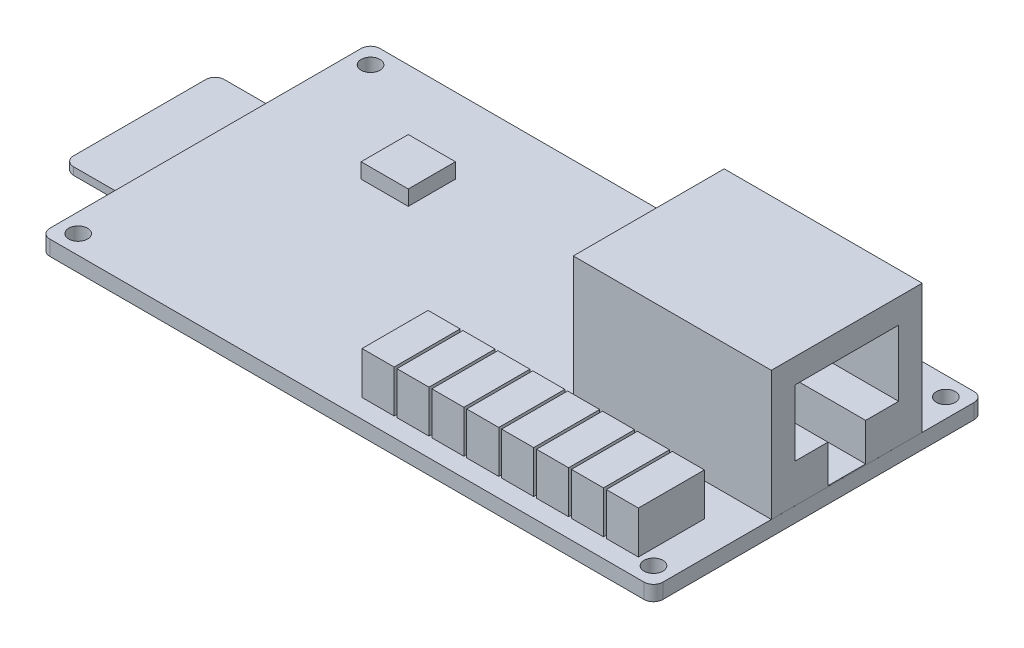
from build123d import *

# Parameters (mm, degrees)
SKIZZE1_W                       = 65
SKIZZE1_H                       = 35
SKIZZE1_R                       = 1
AUFSATZ_LINEAR_AUSTRAGEN1_DEPTH = 1.6
VERRUNDUNG1_R                   = 1
SKIZZE2_W                       = 18
SKIZZE2_H                       = 16
AUFSATZ_LINEAR_AUSTRAGEN2_DEPTH = 3
SKIZZE3_W                       = 15.998
SKIZZE3_H                       = 0.8
AUFSATZ_LINEAR_AUSTRAGEN3_DEPTH = 7
VERRUNDUNG2_R                   = 1
SKIZZE4_W                       = 21
SKIZZE4_H                       = 16
AUFSATZ_LINEAR_AUSTRAGEN4_DEPTH = 13.7
SCHNITT_LINEAR_AUSTRAGEN1_DEPTH = 12
SKIZZE6_W                       = 3.4
SKIZZE6_H                       = 7
AUFSATZ_LINEAR_AUSTRAGEN5_DEPTH = 4.5
SKIZZE7_W                       = 5
SKIZZE7_H                       = 5
AUFSATZ_LINEAR_AUSTRAGEN6_DEPTH = 1.8
SKIZZE8_W                       = 5
SKIZZE8_H                       = 5
AUFSATZ_LINEAR_AUSTRAGEN7_DEPTH = 1.6


with BuildPart() as part:
    # Skizze1 → Aufsatz-Linear austragen1 (new body)
    with BuildSketch(Plane(origin=(0, 0, 0), x_dir=(1, 0, 0), z_dir=(0, 1, 0))):
        Rectangle(SKIZZE1_W, SKIZZE1_H)
        with Locations(Location((-30.5, -15.5, 0), (0, 0, 270))):
            Circle(SKIZZE1_R, mode=Mode.SUBTRACT)
        with Locations(Location((30.5, -15.5, 0), (0, 0, 270))):
            Circle(SKIZZE1_R, mode=Mode.SUBTRACT)
        with Locations(Location((30.5, 15.5, 0), (0, 0, 90))):
            Circle(SKIZZE1_R, mode=Mode.SUBTRACT)
        with Locations(Location((-30.5, 15.5, 0), (0, 0, 90))):
            Circle(SKIZZE1_R, mode=Mode.SUBTRACT)
    extrude(amount=AUFSATZ_LINEAR_AUSTRAGEN1_DEPTH)

    # Verrundung1
    verrundung1_edges = [part.edges().sort_by_distance(p)[0] for p in [
        (32.5, 0.8, -17.5),
        (32.5, 0.8, 17.5),
        (-32.5, 0.8, 17.5),
        (-32.5, 0.8, -17.5),
    ]]
    fillet(verrundung1_edges, radius=VERRUNDUNG1_R)

    # Skizze2 → Aufsatz-Linear austragen2 (add)
    with BuildSketch(Plane.XZ):
        with Locations((-23.49, 0)):
            Rectangle(SKIZZE2_W, SKIZZE2_H)
    extrude(amount=AUFSATZ_LINEAR_AUSTRAGEN2_DEPTH)

    # Skizze3 → Aufsatz-Linear austragen3 (add)
    with BuildSketch(Plane.ZY.offset(32.49)):
        with Locations((0, -0.401)):
            Rectangle(SKIZZE3_W, SKIZZE3_H)
    extrude(amount=AUFSATZ_LINEAR_AUSTRAGEN3_DEPTH)

    # Verrundung2
    verrundung2_edges = [part.edges().sort_by_distance(p)[0] for p in [
        (-39.49, -0.401, -7.999),
        (-39.49, -0.401, 7.999),
    ]]
    fillet(verrundung2_edges, radius=VERRUNDUNG2_R)

    # Skizze4 → Aufsatz-Linear austragen4 (add)
    with BuildSketch(Plane(origin=(0, 1.6, 0), x_dir=(1, 0, 0), z_dir=(0, 1, 0))):
        with Locations((21.999, 3)):
            Rectangle(SKIZZE4_W, SKIZZE4_H)
    extrude(amount=AUFSATZ_LINEAR_AUSTRAGEN4_DEPTH)

    # Skizze5 → Schnitt-Linear austragen1 (cut)
    with BuildSketch(Plane(origin=(32.499, 0, 0), x_dir=(0, 0, -1), z_dir=(1, 0, 0))):
        Polygon((8.5, 12.7), (-2.5, 12.7), (-2.5, 5.7), (1, 5.7), (1, 1.7), (5, 1.7), (5, 5.7), (8.5, 5.7), align=None)
    extrude(amount=-SCHNITT_LINEAR_AUSTRAGEN1_DEPTH, mode=Mode.SUBTRACT)

    # Skizze6 → Aufsatz-Linear austragen5 (add)
    with BuildSketch(Plane(origin=(0, 1.6, 0), x_dir=(1, 0, 0), z_dir=(0, 1, 0))):
        with Locations((27.2, -12)):
            Rectangle(SKIZZE6_W, SKIZZE6_H)
        with Locations((23.5, -12)):
            Rectangle(SKIZZE6_W, SKIZZE6_H)
        with Locations((19.8, -12)):
            Rectangle(SKIZZE6_W, SKIZZE6_H)
        with Locations((16.1, -12)):
            Rectangle(SKIZZE6_W, SKIZZE6_H)
        with Locations((12.4, -12)):
            Rectangle(SKIZZE6_W, SKIZZE6_H)
        with Locations((8.7, -12)):
            Rectangle(SKIZZE6_W, SKIZZE6_H)
        with Locations((5, -12)):
            Rectangle(SKIZZE6_W, SKIZZE6_H)
        with Locations((1.3, -12)):
            Rectangle(SKIZZE6_W, SKIZZE6_H)
    extrude(amount=AUFSATZ_LINEAR_AUSTRAGEN5_DEPTH)

    # Skizze7 → Aufsatz-Linear austragen6 (add)
    with BuildSketch(Plane.XZ):
        with Locations((-0.5, 0)):
            Rectangle(SKIZZE7_W, SKIZZE7_H)
    extrude(amount=AUFSATZ_LINEAR_AUSTRAGEN6_DEPTH)

    # Skizze8 → Aufsatz-Linear austragen7 (add)
    with BuildSketch(Plane(origin=(0, 1.6, 0), x_dir=(1, 0, 0), z_dir=(0, 1, 0))):
        with Locations((-18, 7)):
            Rectangle(SKIZZE8_W, SKIZZE8_H)
    extrude(amount=AUFSATZ_LINEAR_AUSTRAGEN7_DEPTH)


solid = part.part
